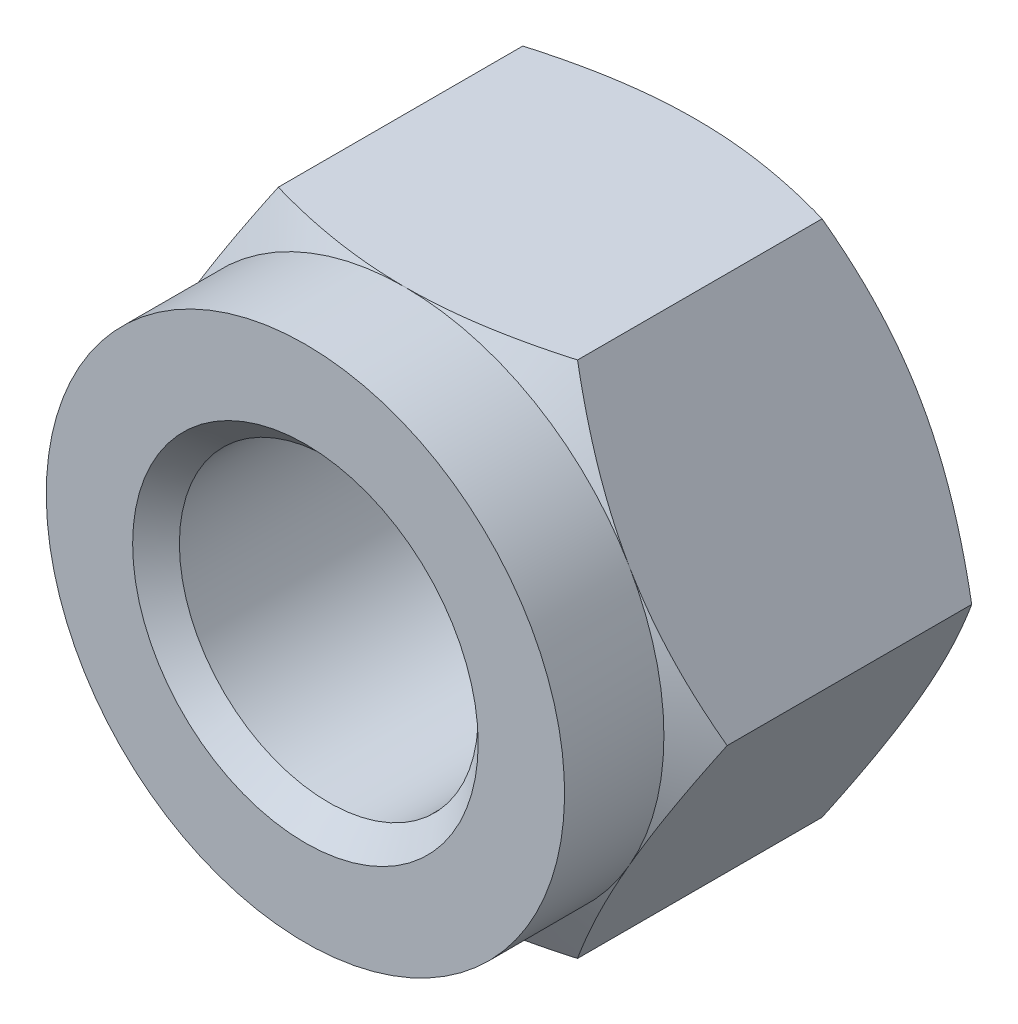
ISO-10303-21;
HEADER;
FILE_DESCRIPTION(('STEP AP214'),'2;1');
FILE_NAME('part.step','',(''),(''),'','','');
FILE_SCHEMA(('AUTOMOTIVE_DESIGN { 1 0 10303 214 1 1 1 1 }'));
ENDSEC;
DATA;
#1=APPLICATION_CONTEXT('core data for automotive mechanical design processes');
#2=APPLICATION_PROTOCOL_DEFINITION('international standard','automotive_design',2000,#1);
#3=PRODUCT_CONTEXT('',#1,'mechanical');
#4=PRODUCT('Part','Part','',(#3));
#5=PRODUCT_RELATED_PRODUCT_CATEGORY('part','',(#4));
#6=PRODUCT_DEFINITION_FORMATION('','',#4);
#7=PRODUCT_DEFINITION_CONTEXT('part definition',#1,'design');
#8=PRODUCT_DEFINITION('design','',#6,#7);
#9=PRODUCT_DEFINITION_SHAPE('','',#8);
#10=(LENGTH_UNIT() NAMED_UNIT(*) SI_UNIT(.MILLI.,.METRE.));
#11=(NAMED_UNIT(*) PLANE_ANGLE_UNIT() SI_UNIT($,.RADIAN.));
#12=(NAMED_UNIT(*) SI_UNIT($,.STERADIAN.) SOLID_ANGLE_UNIT());
#13=UNCERTAINTY_MEASURE_WITH_UNIT(LENGTH_MEASURE(1.E-05),#10,'distance_accuracy_value','');
#14=(GEOMETRIC_REPRESENTATION_CONTEXT(3) GLOBAL_UNCERTAINTY_ASSIGNED_CONTEXT((#13)) GLOBAL_UNIT_ASSIGNED_CONTEXT((#10,
#11,#12)) REPRESENTATION_CONTEXT('',''));
#15=CARTESIAN_POINT('',(0.,0.,0.));
#16=DIRECTION('',(0.,0.,1.));
#17=DIRECTION('',(1.,0.,0.));
#18=AXIS2_PLACEMENT_3D('',#15,#16,#17);
#19=CARTESIAN_POINT('',(0.,0.,0.));
#20=DIRECTION('',(0.,0.,-1.));
#21=DIRECTION('',(0.,1.,0.));
#22=AXIS2_PLACEMENT_3D('',#19,#20,#21);
#23=PLANE('',#22);
#24=CARTESIAN_POINT('',(0.,0.,0.));
#25=DIRECTION('',(0.,0.,-1.));
#26=DIRECTION('',(0.,1.,0.));
#27=AXIS2_PLACEMENT_3D('',#24,#25,#26);
#28=CIRCLE('',#27,18.);
#29=CARTESIAN_POINT('',(0.,18.,0.));
#30=VERTEX_POINT('',#29);
#31=CARTESIAN_POINT('',(15.5884572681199,9.,0.));
#32=VERTEX_POINT('',#31);
#33=EDGE_CURVE('E158',#30,#32,#28,.T.);
#34=ORIENTED_EDGE('',*,*,#33,.T.);
#35=CARTESIAN_POINT('',(15.5884572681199,-9.,0.));
#36=VERTEX_POINT('',#35);
#37=EDGE_CURVE('E163',#32,#36,#28,.T.);
#38=ORIENTED_EDGE('',*,*,#37,.T.);
#39=CARTESIAN_POINT('',(0.,-18.,0.));
#40=VERTEX_POINT('',#39);
#41=EDGE_CURVE('E292',#36,#40,#28,.T.);
#42=ORIENTED_EDGE('',*,*,#41,.T.);
#43=CARTESIAN_POINT('',(-15.5884572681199,-9.,0.));
#44=VERTEX_POINT('',#43);
#45=EDGE_CURVE('E284',#40,#44,#28,.T.);
#46=ORIENTED_EDGE('',*,*,#45,.T.);
#47=CARTESIAN_POINT('',(-15.5884572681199,9.,0.));
#48=VERTEX_POINT('',#47);
#49=EDGE_CURVE('E339',#44,#48,#28,.T.);
#50=ORIENTED_EDGE('',*,*,#49,.T.);
#51=EDGE_CURVE('E152',#48,#30,#28,.T.);
#52=ORIENTED_EDGE('',*,*,#51,.T.);
#53=EDGE_LOOP('',(#34,#38,#42,#46,#50,#52));
#54=FACE_BOUND('',#53,.T.);
#55=CARTESIAN_POINT('',(0.,0.,0.));
#56=DIRECTION('',(0.,0.,-1.));
#57=DIRECTION('',(-1.,0.,0.));
#58=AXIS2_PLACEMENT_3D('',#55,#56,#57);
#59=CIRCLE('',#58,12.);
#60=CARTESIAN_POINT('',(-12.,0.,0.));
#61=VERTEX_POINT('',#60);
#62=EDGE_CURVE('E549',#61,#61,#59,.T.);
#63=ORIENTED_EDGE('',*,*,#62,.F.);
#64=EDGE_LOOP('',(#63));
#65=FACE_BOUND('',#64,.T.);
#66=ADVANCED_FACE('F16',(#54,#65),#23,.T.);
#67=CARTESIAN_POINT('',(0.,0.,27.1));
#68=DIRECTION('',(0.,0.,1.));
#69=DIRECTION('',(1.,0.,0.));
#70=AXIS2_PLACEMENT_3D('',#67,#68,#69);
#71=PLANE('',#70);
#72=CARTESIAN_POINT('',(0.,0.,27.1));
#73=DIRECTION('',(0.,0.,-1.));
#74=DIRECTION('',(0.,1.,0.));
#75=AXIS2_PLACEMENT_3D('',#72,#73,#74);
#76=CIRCLE('',#75,18.);
#77=CARTESIAN_POINT('',(0.,18.,27.1));
#78=VERTEX_POINT('',#77);
#79=EDGE_CURVE('E156',#78,#78,#76,.T.);
#80=ORIENTED_EDGE('',*,*,#79,.F.);
#81=EDGE_LOOP('',(#80));
#82=FACE_BOUND('',#81,.T.);
#83=CARTESIAN_POINT('',(0.,0.,27.1));
#84=DIRECTION('',(0.,0.,-1.));
#85=DIRECTION('',(-1.,0.,0.));
#86=AXIS2_PLACEMENT_3D('',#83,#84,#85);
#87=CIRCLE('',#86,12.);
#88=CARTESIAN_POINT('',(-12.,0.,27.1));
#89=VERTEX_POINT('',#88);
#90=EDGE_CURVE('E553',#89,#89,#87,.T.);
#91=ORIENTED_EDGE('',*,*,#90,.T.);
#92=EDGE_LOOP('',(#91));
#93=FACE_BOUND('',#92,.T.);
#94=ADVANCED_FACE('F357',(#82,#93),#71,.T.);
#95=CARTESIAN_POINT('',(0.,0.,0.));
#96=DIRECTION('',(0.,0.,1.));
#97=DIRECTION('',(0.,-1.,0.));
#98=AXIS2_PLACEMENT_3D('',#95,#96,#97);
#99=CONICAL_SURFACE('',#98,18.,1.0471975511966);
#100=CARTESIAN_POINT('',(-20.784610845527,-1.99999999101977E-06,1.60769582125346));
#101=CARTESIAN_POINT('',(-20.5561932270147,0.395628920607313,1.47583009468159));
#102=CARTESIAN_POINT('',(-20.3268846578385,0.792803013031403,1.34994841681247));
#103=CARTESIAN_POINT('',(-19.8664287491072,1.59033604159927,1.11181647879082));
#104=CARTESIAN_POINT('',(-19.635280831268,1.9906959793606,0.999570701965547));
#105=CARTESIAN_POINT('',(-19.1706995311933,2.79537439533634,0.79021942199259));
#106=CARTESIAN_POINT('',(-18.9372620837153,3.1996999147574,0.693149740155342));
#107=CARTESIAN_POINT('',(-18.4687651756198,4.01116036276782,0.516235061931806));
#108=CARTESIAN_POINT('',(-18.2337058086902,4.41829512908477,0.436389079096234));
#109=CARTESIAN_POINT('',(-17.7679879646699,5.22494209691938,0.297317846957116));
#110=CARTESIAN_POINT('',(-17.5373640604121,5.62439441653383,0.237632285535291));
#111=CARTESIAN_POINT('',(-17.0750595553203,6.42512930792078,0.137553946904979));
#112=CARTESIAN_POINT('',(-16.8433789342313,6.82641191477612,0.0971615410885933));
#113=CARTESIAN_POINT('',(-16.3796285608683,7.62965112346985,0.0366893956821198));
#114=CARTESIAN_POINT('',(-16.1475596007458,8.03160635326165,0.0165855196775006));
#115=CARTESIAN_POINT('',(-15.6832075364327,8.83588772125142,-0.00287722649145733));
#116=CARTESIAN_POINT('',(-15.450924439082,9.23821384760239,-0.0022367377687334));
#117=CARTESIAN_POINT('',(-15.0166733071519,9.99035887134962,0.0183396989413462));
#118=CARTESIAN_POINT('',(-14.814674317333,10.3402313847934,0.0357665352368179));
#119=CARTESIAN_POINT('',(-14.4111581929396,11.0391418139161,0.0859775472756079));
#120=CARTESIAN_POINT('',(-14.209641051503,11.3881797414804,0.118761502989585));
#121=CARTESIAN_POINT('',(-13.8071649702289,12.0852887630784,0.199117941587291));
#122=CARTESIAN_POINT('',(-13.6062067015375,12.4333586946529,0.246703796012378));
#123=CARTESIAN_POINT('',(-13.205246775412,13.1278416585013,0.355824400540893));
#124=CARTESIAN_POINT('',(-13.0052451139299,13.4742546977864,0.417359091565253));
#125=CARTESIAN_POINT('',(-12.3981147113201,14.5258354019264,0.624451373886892));
#126=CARTESIAN_POINT('',(-11.9927440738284,15.2279579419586,0.790657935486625));
#127=CARTESIAN_POINT('',(-11.1880469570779,16.6217342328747,1.1678776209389));
#128=CARTESIAN_POINT('',(-10.788710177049,17.3134058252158,1.37880216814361));
#129=CARTESIAN_POINT('',(-10.3923036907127,18.000002,1.60769582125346));
#130=B_SPLINE_CURVE_WITH_KNOTS('',3,(#100,#101,#102,#103,#104,#105,#106,#107,#108,#109,#110,
#111,#112,#113,#114,#115,#116,#117,#118,#119,#120,#121,#122,#123,#124,#125,#126,#127,#128,#129),
.UNSPECIFIED.,.F.,.F.,(4,2,2,2,2,2,2,2,2,2,2,2,2,2,4),(0.,1.42649553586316,2.85345882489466,
4.28374102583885,5.71394128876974,7.10884191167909,8.50376938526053,9.89703540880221,
11.290258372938,12.5030869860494,13.7158982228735,14.9298082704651,16.1437131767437,
18.6249911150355,21.1013993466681),.UNSPECIFIED.);
#131=CARTESIAN_POINT('',(-10.3923048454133,18.,1.60769515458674));
#132=VERTEX_POINT('',#131);
#133=EDGE_CURVE('E243',#48,#132,#130,.T.);
#134=ORIENTED_EDGE('',*,*,#133,.T.);
#135=CARTESIAN_POINT('',(-27.5623556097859,18.,8.61368935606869));
#136=CARTESIAN_POINT('',(-27.1672177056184,18.,8.42268465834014));
#137=CARTESIAN_POINT('',(-26.771602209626,18.,8.23266845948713));
#138=CARTESIAN_POINT('',(-25.9793151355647,18.,7.85483995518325));
#139=CARTESIAN_POINT('',(-25.5826435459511,18.,7.667027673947));
#140=CARTESIAN_POINT('',(-24.3907771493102,18.,7.10718264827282));
#141=CARTESIAN_POINT('',(-23.5938591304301,18.,6.73880397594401));
#142=CARTESIAN_POINT('',(-21.9899562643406,18.,6.01206116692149));
#143=CARTESIAN_POINT('',(-21.1829399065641,18.,5.6537663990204));
#144=CARTESIAN_POINT('',(-19.5622752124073,18.,4.9525597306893));
#145=CARTESIAN_POINT('',(-18.7486272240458,18.,4.60964702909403));
#146=CARTESIAN_POINT('',(-17.103302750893,18.,3.9392328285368));
#147=CARTESIAN_POINT('',(-16.2715275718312,18.,3.61197227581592));
#148=CARTESIAN_POINT('',(-14.5981607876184,18.,2.98307994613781));
#149=CARTESIAN_POINT('',(-13.7565681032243,18.,2.68145101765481));
#150=CARTESIAN_POINT('',(-12.0639835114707,18.,2.11193037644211));
#151=CARTESIAN_POINT('',(-11.2130159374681,18.,1.84396693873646));
#152=CARTESIAN_POINT('',(-9.49890089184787,18.,1.35046629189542));
#153=CARTESIAN_POINT('',(-8.63575736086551,18.,1.12491568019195));
#154=CARTESIAN_POINT('',(-7.33174610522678,18.,0.826655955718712));
#155=CARTESIAN_POINT('',(-6.89543387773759,18.,0.733898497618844));
#156=CARTESIAN_POINT('',(-6.01990543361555,18.,0.563203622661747));
#157=CARTESIAN_POINT('',(-5.58068928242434,18.,0.485265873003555));
#158=CARTESIAN_POINT('',(-4.69964773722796,18.,0.345592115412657));
#159=CARTESIAN_POINT('',(-4.25782218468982,18.,0.283857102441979));
#160=CARTESIAN_POINT('',(-3.37206807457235,18.,0.177828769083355));
#161=CARTESIAN_POINT('',(-2.92813951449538,18.,0.133535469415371));
#162=CARTESIAN_POINT('',(-2.04164516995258,18.,0.0635830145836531));
#163=CARTESIAN_POINT('',(-1.59908864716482,18.,0.0378072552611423));
#164=CARTESIAN_POINT('',(-0.713283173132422,18.,0.00502539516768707));
#165=CARTESIAN_POINT('',(-0.270034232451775,18.,-0.00198098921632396));
#166=CARTESIAN_POINT('',(0.616237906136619,18.,0.00294207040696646));
#167=CARTESIAN_POINT('',(1.05926113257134,18.,0.0148662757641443));
#168=CARTESIAN_POINT('',(1.94441482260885,18.,0.0573540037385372));
#169=CARTESIAN_POINT('',(2.38654524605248,18.,0.0879183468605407));
#170=CARTESIAN_POINT('',(3.45779585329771,18.,0.183918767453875));
#171=CARTESIAN_POINT('',(4.08609712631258,18.,0.258674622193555));
#172=CARTESIAN_POINT('',(5.33777794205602,18.,0.441667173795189));
#173=CARTESIAN_POINT('',(5.96115674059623,18.,0.549908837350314));
#174=CARTESIAN_POINT('',(7.82499681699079,18.,0.919433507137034));
#175=CARTESIAN_POINT('',(9.05672705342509,18.,1.22527021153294));
#176=CARTESIAN_POINT('',(10.8991905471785,18.,1.75263766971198));
#177=CARTESIAN_POINT('',(11.5195501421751,18.,1.94244300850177));
#178=CARTESIAN_POINT('',(12.7542760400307,18.,2.34097898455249));
#179=CARTESIAN_POINT('',(13.3686417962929,18.,2.54971133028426));
#180=CARTESIAN_POINT('',(14.5883176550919,18.,2.98165368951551));
#181=CARTESIAN_POINT('',(15.193659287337,18.,3.20477542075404));
#182=CARTESIAN_POINT('',(16.097859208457,18.,3.54911869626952));
#183=CARTESIAN_POINT('',(16.3985751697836,18.,3.66549019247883));
#184=CARTESIAN_POINT('',(16.9988388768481,18.,3.90119206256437));
#185=CARTESIAN_POINT('',(17.2983866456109,18.,4.02052237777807));
#186=CARTESIAN_POINT('',(17.5973908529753,18.,4.14119857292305));
#187=B_SPLINE_CURVE_WITH_KNOTS('',3,(#135,#136,#137,#138,#139,#140,#141,#142,#143,#144,#145,
#146,#147,#148,#149,#150,#151,#152,#153,#154,#155,#156,#157,#158,#159,#160,#161,#162,#163,#164,
#165,#166,#167,#168,#169,#170,#171,#172,#173,#174,#175,#176,#177,#178,#179,#180,#181,#182,#183,
#184,#185,#186),.UNSPECIFIED.,.F.,.F.,(4,2,2,2,2,2,2,2,2,2,2,2,2,2,2,2,2,2,2,2,2,2,2,2,2,4),(0.,
1.31664120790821,2.63329686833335,5.26703629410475,7.91584679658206,10.5645191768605,
13.2457156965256,15.9272097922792,18.6028903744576,21.2777240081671,22.6157021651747,
23.9536502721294,25.2916805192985,26.6297123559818,27.959242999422,29.2887535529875,
30.6178962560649,31.9470974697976,33.844218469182,35.7416209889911,39.5437347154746,
41.4898216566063,43.4360844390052,45.3713716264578,46.3387006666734,47.3060105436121),.UNSPECIFIED.);
#188=EDGE_CURVE('E242',#132,#30,#187,.T.);
#189=ORIENTED_EDGE('',*,*,#188,.T.);
#190=ORIENTED_EDGE('',*,*,#51,.F.);
#191=EDGE_LOOP('',(#134,#189,#190));
#192=FACE_BOUND('',#191,.T.);
#193=ADVANCED_FACE('F187',(#192),#99,.T.);
#194=ORIENTED_EDGE('',*,*,#33,.F.);
#195=CARTESIAN_POINT('',(10.3923048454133,18.,1.60769515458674));
#196=VERTEX_POINT('',#195);
#197=EDGE_CURVE('E235',#30,#196,#187,.T.);
#198=ORIENTED_EDGE('',*,*,#197,.T.);
#199=CARTESIAN_POINT('',(10.3923036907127,18.000002,1.60769582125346));
#200=CARTESIAN_POINT('',(10.6207213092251,17.6043710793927,1.4758300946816));
#201=CARTESIAN_POINT('',(10.8500298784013,17.2071969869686,1.34994841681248));
#202=CARTESIAN_POINT('',(11.3104857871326,16.4096639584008,1.11181647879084));
#203=CARTESIAN_POINT('',(11.5416337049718,16.0093040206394,0.999570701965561));
#204=CARTESIAN_POINT('',(12.0062150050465,15.2046256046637,0.790219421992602));
#205=CARTESIAN_POINT('',(12.2396524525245,14.8003000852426,0.693149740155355));
#206=CARTESIAN_POINT('',(12.70814936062,13.9888396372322,0.516235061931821));
#207=CARTESIAN_POINT('',(12.9432087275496,13.5817048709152,0.436389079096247));
#208=CARTESIAN_POINT('',(13.4089265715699,12.7750579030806,0.297317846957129));
#209=CARTESIAN_POINT('',(13.6395504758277,12.3756055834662,0.237632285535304));
#210=CARTESIAN_POINT('',(14.1018549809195,11.5748706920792,0.137553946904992));
#211=CARTESIAN_POINT('',(14.3335356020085,11.1735880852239,0.0971615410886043));
#212=CARTESIAN_POINT('',(14.7972859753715,10.3703488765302,0.0366893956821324));
#213=CARTESIAN_POINT('',(15.029354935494,9.96839364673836,0.0165855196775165));
#214=CARTESIAN_POINT('',(15.4937069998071,9.16411227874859,-0.00287722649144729));
#215=CARTESIAN_POINT('',(15.7259900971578,8.76178615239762,-0.00223673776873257));
#216=CARTESIAN_POINT('',(16.1602412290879,8.00964112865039,0.0183396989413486));
#217=CARTESIAN_POINT('',(16.3622402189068,7.65976861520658,0.0357665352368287));
#218=CARTESIAN_POINT('',(16.7657563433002,6.96085818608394,0.0859775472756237));
#219=CARTESIAN_POINT('',(16.9672734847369,6.61182025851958,0.118761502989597));
#220=CARTESIAN_POINT('',(17.3697495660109,5.91471123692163,0.199117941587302));
#221=CARTESIAN_POINT('',(17.5707078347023,5.5666413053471,0.246703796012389));
#222=CARTESIAN_POINT('',(17.9716677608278,4.87215834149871,0.355824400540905));
#223=CARTESIAN_POINT('',(18.1716694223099,4.52574530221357,0.417359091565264));
#224=CARTESIAN_POINT('',(18.7787998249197,3.47416459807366,0.624451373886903));
#225=CARTESIAN_POINT('',(19.1841704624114,2.7720420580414,0.790657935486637));
#226=CARTESIAN_POINT('',(19.9888675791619,1.3782657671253,1.16787762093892));
#227=CARTESIAN_POINT('',(20.3882043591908,0.686594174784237,1.37880216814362));
#228=CARTESIAN_POINT('',(20.784610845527,-2.00000000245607E-06,1.60769582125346));
#229=B_SPLINE_CURVE_WITH_KNOTS('',3,(#199,#200,#201,#202,#203,#204,#205,#206,#207,#208,#209,
#210,#211,#212,#213,#214,#215,#216,#217,#218,#219,#220,#221,#222,#223,#224,#225,#226,#227,#228),
.UNSPECIFIED.,.F.,.F.,(4,2,2,2,2,2,2,2,2,2,2,2,2,2,4),(0.,1.42649553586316,2.85345882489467,
4.28374102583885,5.71394128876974,7.10884191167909,8.50376938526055,9.89703540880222,
11.290258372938,12.5030869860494,13.7158982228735,14.9298082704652,16.1437131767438,
18.6249911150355,21.1013993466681),.UNSPECIFIED.);
#230=EDGE_CURVE('E229',#196,#32,#229,.T.);
#231=ORIENTED_EDGE('',*,*,#230,.T.);
#232=EDGE_LOOP('',(#194,#198,#231));
#233=FACE_BOUND('',#232,.T.);
#234=ADVANCED_FACE('F330',(#233),#99,.T.);
#235=ORIENTED_EDGE('',*,*,#37,.F.);
#236=CARTESIAN_POINT('',(20.7846096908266,0.,1.60769515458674));
#237=VERTEX_POINT('',#236);
#238=EDGE_CURVE('E46',#32,#237,#229,.T.);
#239=ORIENTED_EDGE('',*,*,#238,.T.);
#240=CARTESIAN_POINT('',(20.784610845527,1.99999999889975E-06,1.60769582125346));
#241=CARTESIAN_POINT('',(20.5561932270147,-0.395628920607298,1.47583009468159));
#242=CARTESIAN_POINT('',(20.3268846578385,-0.792803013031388,1.34994841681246));
#243=CARTESIAN_POINT('',(19.8664287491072,-1.59033604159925,1.11181647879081));
#244=CARTESIAN_POINT('',(19.635280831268,-1.99069597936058,0.99957070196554));
#245=CARTESIAN_POINT('',(19.1706995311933,-2.79537439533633,0.790219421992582));
#246=CARTESIAN_POINT('',(18.9372620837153,-3.19969991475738,0.693149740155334));
#247=CARTESIAN_POINT('',(18.4687651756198,-4.0111603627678,0.516235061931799));
#248=CARTESIAN_POINT('',(18.2337058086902,-4.41829512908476,0.436389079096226));
#249=CARTESIAN_POINT('',(17.7679879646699,-5.22494209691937,0.297317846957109));
#250=CARTESIAN_POINT('',(17.5373640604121,-5.62439441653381,0.237632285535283));
#251=CARTESIAN_POINT('',(17.0750595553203,-6.42512930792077,0.137553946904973));
#252=CARTESIAN_POINT('',(16.8433789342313,-6.8264119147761,0.0971615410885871));
#253=CARTESIAN_POINT('',(16.3796285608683,-7.62965112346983,0.0366893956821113));
#254=CARTESIAN_POINT('',(16.1475596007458,-8.03160635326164,0.0165855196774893));
#255=CARTESIAN_POINT('',(15.6832075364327,-8.8358877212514,-0.00287722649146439));
#256=CARTESIAN_POINT('',(15.450924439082,-9.23821384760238,-0.0022367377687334));
#257=CARTESIAN_POINT('',(15.0166733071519,-9.99035887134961,0.018339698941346));
#258=CARTESIAN_POINT('',(14.814674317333,-10.3402313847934,0.0357665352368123));
#259=CARTESIAN_POINT('',(14.4111581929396,-11.0391418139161,0.0859775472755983));
#260=CARTESIAN_POINT('',(14.2096410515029,-11.3881797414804,0.118761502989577));
#261=CARTESIAN_POINT('',(13.8071649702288,-12.0852887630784,0.199117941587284));
#262=CARTESIAN_POINT('',(13.6062067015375,-12.4333586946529,0.246703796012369));
#263=CARTESIAN_POINT('',(13.205246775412,-13.1278416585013,0.355824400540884));
#264=CARTESIAN_POINT('',(13.0052451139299,-13.4742546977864,0.417359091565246));
#265=CARTESIAN_POINT('',(12.3981147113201,-14.5258354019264,0.624451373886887));
#266=CARTESIAN_POINT('',(11.9927440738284,-15.2279579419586,0.790657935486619));
#267=CARTESIAN_POINT('',(11.1880469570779,-16.6217342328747,1.1678776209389));
#268=CARTESIAN_POINT('',(10.7887101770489,-17.3134058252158,1.3788021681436));
#269=CARTESIAN_POINT('',(10.3923036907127,-18.000002,1.60769582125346));
#270=B_SPLINE_CURVE_WITH_KNOTS('',3,(#240,#241,#242,#243,#244,#245,#246,#247,#248,#249,#250,
#251,#252,#253,#254,#255,#256,#257,#258,#259,#260,#261,#262,#263,#264,#265,#266,#267,#268,#269),
.UNSPECIFIED.,.F.,.F.,(4,2,2,2,2,2,2,2,2,2,2,2,2,2,4),(0.,1.42649553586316,2.85345882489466,
4.28374102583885,5.71394128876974,7.10884191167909,8.50376938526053,9.89703540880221,
11.290258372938,12.5030869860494,13.7158982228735,14.9298082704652,16.1437131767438,
18.6249911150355,21.1013993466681),.UNSPECIFIED.);
#271=EDGE_CURVE('E295',#237,#36,#270,.T.);
#272=ORIENTED_EDGE('',*,*,#271,.T.);
#273=EDGE_LOOP('',(#235,#239,#272));
#274=FACE_BOUND('',#273,.T.);
#275=ADVANCED_FACE('F333',(#274),#99,.T.);
#276=CARTESIAN_POINT('',(-10.3923036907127,-18.000002,1.60769582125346));
#277=CARTESIAN_POINT('',(-10.6207213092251,-17.6043710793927,1.4758300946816));
#278=CARTESIAN_POINT('',(-10.8500298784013,-17.2071969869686,1.34994841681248));
#279=CARTESIAN_POINT('',(-11.3104857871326,-16.4096639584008,1.11181647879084));
#280=CARTESIAN_POINT('',(-11.5416337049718,-16.0093040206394,0.999570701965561));
#281=CARTESIAN_POINT('',(-12.0062150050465,-15.2046256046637,0.790219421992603));
#282=CARTESIAN_POINT('',(-12.2396524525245,-14.8003000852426,0.693149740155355));
#283=CARTESIAN_POINT('',(-12.70814936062,-13.9888396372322,0.516235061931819));
#284=CARTESIAN_POINT('',(-12.9432087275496,-13.5817048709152,0.436389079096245));
#285=CARTESIAN_POINT('',(-13.4089265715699,-12.7750579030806,0.297317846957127));
#286=CARTESIAN_POINT('',(-13.6395504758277,-12.3756055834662,0.237632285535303));
#287=CARTESIAN_POINT('',(-14.1018549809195,-11.5748706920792,0.137553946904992));
#288=CARTESIAN_POINT('',(-14.3335356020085,-11.1735880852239,0.0971615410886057));
#289=CARTESIAN_POINT('',(-14.7972859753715,-10.3703488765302,0.036689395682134));
#290=CARTESIAN_POINT('',(-15.029354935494,-9.96839364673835,0.0165855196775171));
#291=CARTESIAN_POINT('',(-15.4937069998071,-9.16411227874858,-0.00287722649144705));
#292=CARTESIAN_POINT('',(-15.7259900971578,-8.76178615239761,-0.0022367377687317));
#293=CARTESIAN_POINT('',(-16.1602412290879,-8.00964112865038,0.0183396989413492));
#294=CARTESIAN_POINT('',(-16.3622402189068,-7.65976861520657,0.0357665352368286));
#295=CARTESIAN_POINT('',(-16.7657563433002,-6.96085818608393,0.0859775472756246));
#296=CARTESIAN_POINT('',(-16.9672734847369,-6.61182025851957,0.1187615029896));
#297=CARTESIAN_POINT('',(-17.3697495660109,-5.91471123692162,0.199117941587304));
#298=CARTESIAN_POINT('',(-17.5707078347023,-5.5666413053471,0.24670379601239));
#299=CARTESIAN_POINT('',(-17.9716677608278,-4.8721583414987,0.355824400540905));
#300=CARTESIAN_POINT('',(-18.1716694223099,-4.52574530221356,0.417359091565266));
#301=CARTESIAN_POINT('',(-18.7787998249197,-3.47416459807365,0.624451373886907));
#302=CARTESIAN_POINT('',(-19.1841704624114,-2.77204205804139,0.790657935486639));
#303=CARTESIAN_POINT('',(-19.9888675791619,-1.3782657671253,1.16787762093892));
#304=CARTESIAN_POINT('',(-20.3882043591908,-0.686594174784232,1.37880216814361));
#305=CARTESIAN_POINT('',(-20.784610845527,2.00000000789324E-06,1.60769582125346));
#306=B_SPLINE_CURVE_WITH_KNOTS('',3,(#276,#277,#278,#279,#280,#281,#282,#283,#284,#285,#286,
#287,#288,#289,#290,#291,#292,#293,#294,#295,#296,#297,#298,#299,#300,#301,#302,#303,#304,#305),
.UNSPECIFIED.,.F.,.F.,(4,2,2,2,2,2,2,2,2,2,2,2,2,2,4),(0.,1.42649553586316,2.85345882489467,
4.28374102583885,5.71394128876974,7.10884191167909,8.50376938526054,9.89703540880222,
11.290258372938,12.5030869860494,13.7158982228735,14.9298082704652,16.1437131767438,
18.6249911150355,21.1013993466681),.UNSPECIFIED.);
#307=CARTESIAN_POINT('',(-20.7846096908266,0.,1.60769515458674));
#308=VERTEX_POINT('',#307);
#309=EDGE_CURVE('E299',#44,#308,#306,.T.);
#310=ORIENTED_EDGE('',*,*,#309,.T.);
#311=EDGE_CURVE('E230',#308,#48,#130,.T.);
#312=ORIENTED_EDGE('',*,*,#311,.T.);
#313=ORIENTED_EDGE('',*,*,#49,.F.);
#314=EDGE_LOOP('',(#310,#312,#313));
#315=FACE_BOUND('',#314,.T.);
#316=ADVANCED_FACE('F393',(#315),#99,.T.);
#317=ORIENTED_EDGE('',*,*,#41,.F.);
#318=CARTESIAN_POINT('',(10.3923048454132,-18.,1.60769515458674));
#319=VERTEX_POINT('',#318);
#320=EDGE_CURVE('E38',#36,#319,#270,.T.);
#321=ORIENTED_EDGE('',*,*,#320,.T.);
#322=CARTESIAN_POINT('',(-27.5623556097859,-18.,8.61368935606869));
#323=CARTESIAN_POINT('',(-27.1672177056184,-18.,8.42268465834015));
#324=CARTESIAN_POINT('',(-26.771602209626,-18.,8.23266845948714));
#325=CARTESIAN_POINT('',(-25.9793151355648,-18.,7.85483995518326));
#326=CARTESIAN_POINT('',(-25.5826435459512,-18.,7.66702767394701));
#327=CARTESIAN_POINT('',(-24.3907771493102,-18.,7.10718264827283));
#328=CARTESIAN_POINT('',(-23.5938591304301,-18.,6.73880397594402));
#329=CARTESIAN_POINT('',(-21.9899562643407,-18.,6.0120611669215));
#330=CARTESIAN_POINT('',(-21.1829399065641,-18.,5.65376639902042));
#331=CARTESIAN_POINT('',(-19.5622752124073,-18.,4.95255973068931));
#332=CARTESIAN_POINT('',(-18.7486272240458,-18.,4.60964702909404));
#333=CARTESIAN_POINT('',(-17.103302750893,-18.,3.93923282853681));
#334=CARTESIAN_POINT('',(-16.2715275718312,-18.,3.61197227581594));
#335=CARTESIAN_POINT('',(-14.5981607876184,-18.,2.98307994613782));
#336=CARTESIAN_POINT('',(-13.7565681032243,-18.,2.68145101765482));
#337=CARTESIAN_POINT('',(-12.0639835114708,-18.,2.11193037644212));
#338=CARTESIAN_POINT('',(-11.2130159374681,-18.,1.84396693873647));
#339=CARTESIAN_POINT('',(-9.4989008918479,-18.,1.35046629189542));
#340=CARTESIAN_POINT('',(-8.63575736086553,-18.,1.12491568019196));
#341=CARTESIAN_POINT('',(-7.3317461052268,-18.,0.826655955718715));
#342=CARTESIAN_POINT('',(-6.89543387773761,-18.,0.733898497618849));
#343=CARTESIAN_POINT('',(-6.01990543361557,-18.,0.563203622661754));
#344=CARTESIAN_POINT('',(-5.58068928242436,-18.,0.485265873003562));
#345=CARTESIAN_POINT('',(-4.69964773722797,-18.,0.345592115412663));
#346=CARTESIAN_POINT('',(-4.25782218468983,-18.,0.283857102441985));
#347=CARTESIAN_POINT('',(-3.37206807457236,-18.,0.17782876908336));
#348=CARTESIAN_POINT('',(-2.92813951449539,-18.,0.133535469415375));
#349=CARTESIAN_POINT('',(-2.0416451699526,-18.,0.0635830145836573));
#350=CARTESIAN_POINT('',(-1.59908864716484,-18.,0.037807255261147));
#351=CARTESIAN_POINT('',(-0.713283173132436,-18.,0.00502539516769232));
#352=CARTESIAN_POINT('',(-0.270034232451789,-18.,-0.00198098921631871));
#353=CARTESIAN_POINT('',(0.616237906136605,-18.,0.00294207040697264));
#354=CARTESIAN_POINT('',(1.05926113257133,-18.,0.0148662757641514));
#355=CARTESIAN_POINT('',(1.94441482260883,-18.,0.0573540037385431));
#356=CARTESIAN_POINT('',(2.38654524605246,-18.,0.0879183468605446));
#357=CARTESIAN_POINT('',(3.4577958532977,-18.,0.183918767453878));
#358=CARTESIAN_POINT('',(4.08609712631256,-18.,0.258674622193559));
#359=CARTESIAN_POINT('',(5.33777794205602,-18.,0.441667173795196));
#360=CARTESIAN_POINT('',(5.96115674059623,-18.,0.549908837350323));
#361=CARTESIAN_POINT('',(7.82499681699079,-18.,0.919433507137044));
#362=CARTESIAN_POINT('',(9.05672705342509,-18.,1.22527021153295));
#363=CARTESIAN_POINT('',(10.8991905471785,-18.,1.75263766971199));
#364=CARTESIAN_POINT('',(11.5195501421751,-18.,1.94244300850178));
#365=CARTESIAN_POINT('',(12.7542760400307,-18.,2.3409789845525));
#366=CARTESIAN_POINT('',(13.3686417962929,-18.,2.54971133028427));
#367=CARTESIAN_POINT('',(14.5883176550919,-18.,2.98165368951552));
#368=CARTESIAN_POINT('',(15.193659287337,-18.,3.20477542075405));
#369=CARTESIAN_POINT('',(16.097859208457,-18.,3.54911869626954));
#370=CARTESIAN_POINT('',(16.3985751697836,-18.,3.66549019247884));
#371=CARTESIAN_POINT('',(16.9988388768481,-18.,3.90119206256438));
#372=CARTESIAN_POINT('',(17.2983866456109,-18.,4.02052237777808));
#373=CARTESIAN_POINT('',(17.5973908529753,-18.,4.14119857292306));
#374=B_SPLINE_CURVE_WITH_KNOTS('',3,(#322,#323,#324,#325,#326,#327,#328,#329,#330,#331,#332,
#333,#334,#335,#336,#337,#338,#339,#340,#341,#342,#343,#344,#345,#346,#347,#348,#349,#350,#351,
#352,#353,#354,#355,#356,#357,#358,#359,#360,#361,#362,#363,#364,#365,#366,#367,#368,#369,#370,
#371,#372,#373),.UNSPECIFIED.,.F.,.F.,(4,2,2,2,2,2,2,2,2,2,2,2,2,2,2,2,2,2,2,2,2,2,2,2,2,4),(0.,
1.31664120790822,2.63329686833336,5.26703629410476,7.91584679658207,10.5645191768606,
13.2457156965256,15.9272097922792,18.6028903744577,21.2777240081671,22.6157021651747,
23.9536502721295,25.2916805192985,26.6297123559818,27.959242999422,29.2887535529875,
30.6178962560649,31.9470974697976,33.844218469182,35.7416209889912,39.5437347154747,
41.4898216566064,43.4360844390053,45.3713716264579,46.3387006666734,47.3060105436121),.UNSPECIFIED.);
#375=EDGE_CURVE('E10',#319,#40,#374,.F.);
#376=ORIENTED_EDGE('',*,*,#375,.T.);
#377=EDGE_LOOP('',(#317,#321,#376));
#378=FACE_BOUND('',#377,.T.);
#379=ADVANCED_FACE('F291',(#378),#99,.T.);
#380=CARTESIAN_POINT('',(-10.3923048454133,-18.,1.60769515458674));
#381=VERTEX_POINT('',#380);
#382=EDGE_CURVE('E21',#40,#381,#374,.F.);
#383=ORIENTED_EDGE('',*,*,#382,.T.);
#384=EDGE_CURVE('E142',#381,#44,#306,.T.);
#385=ORIENTED_EDGE('',*,*,#384,.T.);
#386=ORIENTED_EDGE('',*,*,#45,.F.);
#387=EDGE_LOOP('',(#383,#385,#386));
#388=FACE_BOUND('',#387,.T.);
#389=ADVANCED_FACE('F280',(#388),#99,.T.);
#390=CARTESIAN_POINT('',(10.3923048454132,-18.,21.2));
#391=DIRECTION('',(-0.866025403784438,0.5,0.));
#392=DIRECTION('',(-0.5,-0.866025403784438,0.));
#393=AXIS2_PLACEMENT_3D('',#390,#391,#392);
#394=PLANE('',#393);
#395=CARTESIAN_POINT('',(10.3923036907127,-18.000002,18.5923041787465));
#396=CARTESIAN_POINT('',(10.6207213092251,-17.6043710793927,18.7241699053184));
#397=CARTESIAN_POINT('',(10.8500298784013,-17.2071969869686,18.8500515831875));
#398=CARTESIAN_POINT('',(11.3104857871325,-16.4096639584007,19.0881835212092));
#399=CARTESIAN_POINT('',(11.5416337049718,-16.0093040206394,19.2004292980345));
#400=CARTESIAN_POINT('',(12.0062150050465,-15.2046256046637,19.4097805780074));
#401=CARTESIAN_POINT('',(12.2396524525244,-14.8003000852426,19.5068502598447));
#402=CARTESIAN_POINT('',(12.70814936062,-13.9888396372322,19.6837649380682));
#403=CARTESIAN_POINT('',(12.9432087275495,-13.5817048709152,19.7636109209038));
#404=CARTESIAN_POINT('',(13.4089265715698,-12.7750579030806,19.9026821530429));
#405=CARTESIAN_POINT('',(13.6395504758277,-12.3756055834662,19.9623677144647));
#406=CARTESIAN_POINT('',(14.1018549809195,-11.5748706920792,20.062446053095));
#407=CARTESIAN_POINT('',(14.3335356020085,-11.1735880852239,20.1028384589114));
#408=CARTESIAN_POINT('',(14.7972859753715,-10.3703488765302,20.1633106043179));
#409=CARTESIAN_POINT('',(15.029354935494,-9.96839364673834,20.1834144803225));
#410=CARTESIAN_POINT('',(15.4937069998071,-9.16411227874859,20.2028772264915));
#411=CARTESIAN_POINT('',(15.7259900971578,-8.76178615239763,20.2022367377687));
#412=CARTESIAN_POINT('',(16.1602412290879,-8.0096411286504,20.1816603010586));
#413=CARTESIAN_POINT('',(16.3622402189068,-7.65976861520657,20.1642334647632));
#414=CARTESIAN_POINT('',(16.7657563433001,-6.96085818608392,20.1140224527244));
#415=CARTESIAN_POINT('',(16.9672734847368,-6.61182025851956,20.0812384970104));
#416=CARTESIAN_POINT('',(17.3697495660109,-5.91471123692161,20.0008820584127));
#417=CARTESIAN_POINT('',(17.5707078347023,-5.56664130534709,19.9532962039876));
#418=CARTESIAN_POINT('',(17.9716677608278,-4.8721583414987,19.8441755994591));
#419=CARTESIAN_POINT('',(18.1716694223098,-4.52574530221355,19.7826409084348));
#420=CARTESIAN_POINT('',(18.7787998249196,-3.47416459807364,19.5755486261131));
#421=CARTESIAN_POINT('',(19.1841704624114,-2.77204205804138,19.4093420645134));
#422=CARTESIAN_POINT('',(19.9888675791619,-1.37826576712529,19.0321223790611));
#423=CARTESIAN_POINT('',(20.3882043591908,-0.686594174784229,18.8211978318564));
#424=CARTESIAN_POINT('',(20.784610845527,2.00000000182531E-06,18.5923041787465));
#425=B_SPLINE_CURVE_WITH_KNOTS('',3,(#395,#396,#397,#398,#399,#400,#401,#402,#403,#404,#405,
#406,#407,#408,#409,#410,#411,#412,#413,#414,#415,#416,#417,#418,#419,#420,#421,#422,#423,#424),
.UNSPECIFIED.,.F.,.F.,(4,2,2,2,2,2,2,2,2,2,2,2,2,2,4),(0.,1.42649553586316,2.85345882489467,
4.28374102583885,5.71394128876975,7.1088419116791,8.50376938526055,9.89703540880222,
11.290258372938,12.5030869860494,13.7158982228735,14.9298082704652,16.1437131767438,
18.6249911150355,21.1013993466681),.UNSPECIFIED.);
#426=CARTESIAN_POINT('',(15.5884572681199,-9.,20.2));
#427=VERTEX_POINT('',#426);
#428=CARTESIAN_POINT('',(20.7846096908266,0.,18.5923048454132));
#429=VERTEX_POINT('',#428);
#430=EDGE_CURVE('E131',#427,#429,#425,.T.);
#431=ORIENTED_EDGE('',*,*,#430,.F.);
#432=CARTESIAN_POINT('',(10.3923048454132,-18.,18.5923048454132));
#433=VERTEX_POINT('',#432);
#434=EDGE_CURVE('E132',#433,#427,#425,.T.);
#435=ORIENTED_EDGE('',*,*,#434,.F.);
#436=DIRECTION('',(0.,0.,-1.));
#437=VECTOR('',#436,1.);
#438=CARTESIAN_POINT('',(10.3923048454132,-18.,21.2));
#439=LINE('',#438,#437);
#440=EDGE_CURVE('E244',#433,#319,#439,.T.);
#441=ORIENTED_EDGE('',*,*,#440,.T.);
#442=ORIENTED_EDGE('',*,*,#320,.F.);
#443=ORIENTED_EDGE('',*,*,#271,.F.);
#444=DIRECTION('',(0.,0.,-1.));
#445=VECTOR('',#444,1.);
#446=CARTESIAN_POINT('',(20.7846096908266,0.,21.2));
#447=LINE('',#446,#445);
#448=EDGE_CURVE('E133',#429,#237,#447,.T.);
#449=ORIENTED_EDGE('',*,*,#448,.F.);
#450=EDGE_LOOP('',(#431,#435,#441,#442,#443,#449));
#451=FACE_BOUND('',#450,.T.);
#452=ADVANCED_FACE('F18',(#451),#394,.F.);
#453=CARTESIAN_POINT('',(20.7846096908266,0.,21.2));
#454=DIRECTION('',(-0.866025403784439,-0.5,0.));
#455=DIRECTION('',(0.5,-0.866025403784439,0.));
#456=AXIS2_PLACEMENT_3D('',#453,#454,#455);
#457=PLANE('',#456);
#458=CARTESIAN_POINT('',(20.784610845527,-2.00000000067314E-06,18.5923041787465));
#459=CARTESIAN_POINT('',(20.5561932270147,0.395628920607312,18.7241699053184));
#460=CARTESIAN_POINT('',(20.3268846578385,0.792803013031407,18.8500515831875));
#461=CARTESIAN_POINT('',(19.8664287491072,1.59033604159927,19.0881835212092));
#462=CARTESIAN_POINT('',(19.635280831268,1.9906959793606,19.2004292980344));
#463=CARTESIAN_POINT('',(19.1706995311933,2.79537439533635,19.4097805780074));
#464=CARTESIAN_POINT('',(18.9372620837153,3.1996999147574,19.5068502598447));
#465=CARTESIAN_POINT('',(18.4687651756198,4.01116036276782,19.6837649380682));
#466=CARTESIAN_POINT('',(18.2337058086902,4.41829512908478,19.7636109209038));
#467=CARTESIAN_POINT('',(17.7679879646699,5.22494209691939,19.9026821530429));
#468=CARTESIAN_POINT('',(17.5373640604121,5.62439441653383,19.9623677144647));
#469=CARTESIAN_POINT('',(17.0750595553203,6.42512930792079,20.062446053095));
#470=CARTESIAN_POINT('',(16.8433789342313,6.82641191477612,20.1028384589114));
#471=CARTESIAN_POINT('',(16.3796285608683,7.62965112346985,20.1633106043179));
#472=CARTESIAN_POINT('',(16.1475596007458,8.03160635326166,20.1834144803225));
#473=CARTESIAN_POINT('',(15.6832075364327,8.83588772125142,20.2028772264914));
#474=CARTESIAN_POINT('',(15.450924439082,9.23821384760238,20.2022367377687));
#475=CARTESIAN_POINT('',(15.0166733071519,9.99035887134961,20.1816603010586));
#476=CARTESIAN_POINT('',(14.814674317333,10.3402313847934,20.1642334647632));
#477=CARTESIAN_POINT('',(14.4111581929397,11.0391418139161,20.1140224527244));
#478=CARTESIAN_POINT('',(14.209641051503,11.3881797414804,20.0812384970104));
#479=CARTESIAN_POINT('',(13.8071649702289,12.0852887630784,20.0008820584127));
#480=CARTESIAN_POINT('',(13.6062067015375,12.4333586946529,19.9532962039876));
#481=CARTESIAN_POINT('',(13.205246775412,13.1278416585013,19.8441755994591));
#482=CARTESIAN_POINT('',(13.00524511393,13.4742546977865,19.7826409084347));
#483=CARTESIAN_POINT('',(12.3981147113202,14.5258354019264,19.5755486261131));
#484=CARTESIAN_POINT('',(11.9927440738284,15.2279579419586,19.4093420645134));
#485=CARTESIAN_POINT('',(11.1880469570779,16.6217342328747,19.0321223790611));
#486=CARTESIAN_POINT('',(10.788710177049,17.3134058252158,18.8211978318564));
#487=CARTESIAN_POINT('',(10.3923036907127,18.000002,18.5923041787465));
#488=B_SPLINE_CURVE_WITH_KNOTS('',3,(#458,#459,#460,#461,#462,#463,#464,#465,#466,#467,#468,
#469,#470,#471,#472,#473,#474,#475,#476,#477,#478,#479,#480,#481,#482,#483,#484,#485,#486,#487),
.UNSPECIFIED.,.F.,.F.,(4,2,2,2,2,2,2,2,2,2,2,2,2,2,4),(0.,1.42649553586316,2.85345882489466,
4.28374102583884,5.71394128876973,7.10884191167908,8.50376938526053,9.8970354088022,
11.290258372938,12.5030869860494,13.7158982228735,14.9298082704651,16.1437131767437,
18.6249911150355,21.1013993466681),.UNSPECIFIED.);
#489=CARTESIAN_POINT('',(15.5884572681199,9.,20.2));
#490=VERTEX_POINT('',#489);
#491=CARTESIAN_POINT('',(10.3923048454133,18.,18.5923048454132));
#492=VERTEX_POINT('',#491);
#493=EDGE_CURVE('E205',#490,#492,#488,.T.);
#494=ORIENTED_EDGE('',*,*,#493,.F.);
#495=EDGE_CURVE('E137',#429,#490,#488,.T.);
#496=ORIENTED_EDGE('',*,*,#495,.F.);
#497=ORIENTED_EDGE('',*,*,#448,.T.);
#498=ORIENTED_EDGE('',*,*,#238,.F.);
#499=ORIENTED_EDGE('',*,*,#230,.F.);
#500=DIRECTION('',(0.,0.,-1.));
#501=VECTOR('',#500,1.);
#502=CARTESIAN_POINT('',(10.3923048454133,18.,21.2));
#503=LINE('',#502,#501);
#504=EDGE_CURVE('E258',#492,#196,#503,.T.);
#505=ORIENTED_EDGE('',*,*,#504,.F.);
#506=EDGE_LOOP('',(#494,#496,#497,#498,#499,#505));
#507=FACE_BOUND('',#506,.T.);
#508=ADVANCED_FACE('F216',(#507),#457,.F.);
#509=CARTESIAN_POINT('',(10.3923048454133,18.,21.2));
#510=DIRECTION('',(0.,-1.,0.));
#511=DIRECTION('',(1.,0.,0.));
#512=AXIS2_PLACEMENT_3D('',#509,#510,#511);
#513=PLANE('',#512);
#514=CARTESIAN_POINT('',(-27.5623556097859,18.,11.5863106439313));
#515=CARTESIAN_POINT('',(-27.1672177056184,18.,11.7773153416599));
#516=CARTESIAN_POINT('',(-26.771602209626,18.,11.9673315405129));
#517=CARTESIAN_POINT('',(-25.9793151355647,18.,12.3451600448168));
#518=CARTESIAN_POINT('',(-25.5826435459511,18.,12.532972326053));
#519=CARTESIAN_POINT('',(-24.3907771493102,18.,13.0928173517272));
#520=CARTESIAN_POINT('',(-23.5938591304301,18.,13.461196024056));
#521=CARTESIAN_POINT('',(-21.9899562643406,18.,14.1879388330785));
#522=CARTESIAN_POINT('',(-21.1829399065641,18.,14.5462336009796));
#523=CARTESIAN_POINT('',(-19.5622752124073,18.,15.2474402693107));
#524=CARTESIAN_POINT('',(-18.7486272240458,18.,15.590352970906));
#525=CARTESIAN_POINT('',(-17.103302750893,18.,16.2607671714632));
#526=CARTESIAN_POINT('',(-16.2715275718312,18.,16.5880277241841));
#527=CARTESIAN_POINT('',(-14.5981607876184,18.,17.2169200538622));
#528=CARTESIAN_POINT('',(-13.7565681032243,18.,17.5185489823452));
#529=CARTESIAN_POINT('',(-12.0639835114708,18.,18.0880696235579));
#530=CARTESIAN_POINT('',(-11.2130159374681,18.,18.3560330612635));
#531=CARTESIAN_POINT('',(-9.49890089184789,18.,18.8495337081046));
#532=CARTESIAN_POINT('',(-8.63575736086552,18.,19.0750843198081));
#533=CARTESIAN_POINT('',(-7.33174610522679,18.,19.3733440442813));
#534=CARTESIAN_POINT('',(-6.8954338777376,18.,19.4661015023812));
#535=CARTESIAN_POINT('',(-6.01990543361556,18.,19.6367963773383));
#536=CARTESIAN_POINT('',(-5.58068928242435,18.,19.7147341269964));
#537=CARTESIAN_POINT('',(-4.69964773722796,18.,19.8544078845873));
#538=CARTESIAN_POINT('',(-4.25782218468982,18.,19.916142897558));
#539=CARTESIAN_POINT('',(-3.37206807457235,18.,20.0221712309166));
#540=CARTESIAN_POINT('',(-2.92813951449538,18.,20.0664645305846));
#541=CARTESIAN_POINT('',(-2.04164516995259,18.,20.1364169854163));
#542=CARTESIAN_POINT('',(-1.59908864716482,18.,20.1621927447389));
#543=CARTESIAN_POINT('',(-0.713283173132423,18.,20.1949746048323));
#544=CARTESIAN_POINT('',(-0.270034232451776,18.,20.2019809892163));
#545=CARTESIAN_POINT('',(0.616237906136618,18.,20.197057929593));
#546=CARTESIAN_POINT('',(1.05926113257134,18.,20.1851337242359));
#547=CARTESIAN_POINT('',(1.94441482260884,18.,20.1426459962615));
#548=CARTESIAN_POINT('',(2.38654524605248,18.,20.1120816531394));
#549=CARTESIAN_POINT('',(3.45779585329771,18.,20.0160812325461));
#550=CARTESIAN_POINT('',(4.08609712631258,18.,19.9413253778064));
#551=CARTESIAN_POINT('',(5.33777794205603,18.,19.7583328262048));
#552=CARTESIAN_POINT('',(5.96115674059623,18.,19.6500911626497));
#553=CARTESIAN_POINT('',(7.82499681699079,18.,19.280566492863));
#554=CARTESIAN_POINT('',(9.05672705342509,18.,18.9747297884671));
#555=CARTESIAN_POINT('',(10.8991905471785,18.,18.447362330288));
#556=CARTESIAN_POINT('',(11.5195501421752,18.,18.2575569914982));
#557=CARTESIAN_POINT('',(12.7542760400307,18.,17.8590210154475));
#558=CARTESIAN_POINT('',(13.3686417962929,18.,17.6502886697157));
#559=CARTESIAN_POINT('',(14.5883176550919,18.,17.2183463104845));
#560=CARTESIAN_POINT('',(15.193659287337,18.,16.995224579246));
#561=CARTESIAN_POINT('',(16.097859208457,18.,16.6508813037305));
#562=CARTESIAN_POINT('',(16.3985751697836,18.,16.5345098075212));
#563=CARTESIAN_POINT('',(16.9988388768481,18.,16.2988079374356));
#564=CARTESIAN_POINT('',(17.2983866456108,18.,16.1794776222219));
#565=CARTESIAN_POINT('',(17.5973908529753,18.,16.058801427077));
#566=B_SPLINE_CURVE_WITH_KNOTS('',3,(#514,#515,#516,#517,#518,#519,#520,#521,#522,#523,#524,
#525,#526,#527,#528,#529,#530,#531,#532,#533,#534,#535,#536,#537,#538,#539,#540,#541,#542,#543,
#544,#545,#546,#547,#548,#549,#550,#551,#552,#553,#554,#555,#556,#557,#558,#559,#560,#561,#562,
#563,#564,#565),.UNSPECIFIED.,.F.,.F.,(4,2,2,2,2,2,2,2,2,2,2,2,2,2,2,2,2,2,2,2,2,2,2,2,2,4),(0.,
1.31664120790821,2.63329686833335,5.26703629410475,7.91584679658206,10.5645191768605,
13.2457156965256,15.9272097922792,18.6028903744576,21.2777240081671,22.6157021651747,
23.9536502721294,25.2916805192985,26.6297123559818,27.959242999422,29.2887535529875,
30.6178962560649,31.9470974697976,33.844218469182,35.7416209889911,39.5437347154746,
41.4898216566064,43.4360844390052,45.3713716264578,46.3387006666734,47.3060105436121),.UNSPECIFIED.);
#567=CARTESIAN_POINT('',(0.,18.,20.2));
#568=VERTEX_POINT('',#567);
#569=CARTESIAN_POINT('',(-10.3923048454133,18.,18.5923048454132));
#570=VERTEX_POINT('',#569);
#571=EDGE_CURVE('E199',#568,#570,#566,.F.);
#572=ORIENTED_EDGE('',*,*,#571,.F.);
#573=EDGE_CURVE('E211',#492,#568,#566,.F.);
#574=ORIENTED_EDGE('',*,*,#573,.F.);
#575=ORIENTED_EDGE('',*,*,#504,.T.);
#576=ORIENTED_EDGE('',*,*,#197,.F.);
#577=ORIENTED_EDGE('',*,*,#188,.F.);
#578=DIRECTION('',(0.,0.,-1.));
#579=VECTOR('',#578,1.);
#580=CARTESIAN_POINT('',(-10.3923048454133,18.,21.2));
#581=LINE('',#580,#579);
#582=EDGE_CURVE('E254',#570,#132,#581,.T.);
#583=ORIENTED_EDGE('',*,*,#582,.F.);
#584=EDGE_LOOP('',(#572,#574,#575,#576,#577,#583));
#585=FACE_BOUND('',#584,.T.);
#586=ADVANCED_FACE('F219',(#585),#513,.F.);
#587=CARTESIAN_POINT('',(-10.3923048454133,18.,21.2));
#588=DIRECTION('',(0.866025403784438,-0.5,0.));
#589=DIRECTION('',(0.5,0.866025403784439,0.));
#590=AXIS2_PLACEMENT_3D('',#587,#588,#589);
#591=PLANE('',#590);
#592=CARTESIAN_POINT('',(-10.3923036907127,18.000002,18.5923041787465));
#593=CARTESIAN_POINT('',(-10.6207213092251,17.6043710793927,18.7241699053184));
#594=CARTESIAN_POINT('',(-10.8500298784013,17.2071969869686,18.8500515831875));
#595=CARTESIAN_POINT('',(-11.3104857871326,16.4096639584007,19.0881835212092));
#596=CARTESIAN_POINT('',(-11.5416337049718,16.0093040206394,19.2004292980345));
#597=CARTESIAN_POINT('',(-12.0062150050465,15.2046256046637,19.4097805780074));
#598=CARTESIAN_POINT('',(-12.2396524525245,14.8003000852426,19.5068502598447));
#599=CARTESIAN_POINT('',(-12.70814936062,13.9888396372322,19.6837649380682));
#600=CARTESIAN_POINT('',(-12.9432087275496,13.5817048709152,19.7636109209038));
#601=CARTESIAN_POINT('',(-13.4089265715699,12.7750579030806,19.9026821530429));
#602=CARTESIAN_POINT('',(-13.6395504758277,12.3756055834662,19.9623677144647));
#603=CARTESIAN_POINT('',(-14.1018549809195,11.5748706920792,20.062446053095));
#604=CARTESIAN_POINT('',(-14.3335356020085,11.1735880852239,20.1028384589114));
#605=CARTESIAN_POINT('',(-14.7972859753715,10.3703488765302,20.1633106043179));
#606=CARTESIAN_POINT('',(-15.029354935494,9.96839364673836,20.1834144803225));
#607=CARTESIAN_POINT('',(-15.4937069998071,9.1641122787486,20.2028772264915));
#608=CARTESIAN_POINT('',(-15.7259900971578,8.76178615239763,20.2022367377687));
#609=CARTESIAN_POINT('',(-16.1602412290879,8.0096411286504,20.1816603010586));
#610=CARTESIAN_POINT('',(-16.3622402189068,7.65976861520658,20.1642334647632));
#611=CARTESIAN_POINT('',(-16.7657563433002,6.96085818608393,20.1140224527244));
#612=CARTESIAN_POINT('',(-16.9672734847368,6.61182025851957,20.0812384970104));
#613=CARTESIAN_POINT('',(-17.3697495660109,5.91471123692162,20.0008820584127));
#614=CARTESIAN_POINT('',(-17.5707078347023,5.5666413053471,19.9532962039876));
#615=CARTESIAN_POINT('',(-17.9716677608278,4.87215834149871,19.8441755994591));
#616=CARTESIAN_POINT('',(-18.1716694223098,4.52574530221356,19.7826409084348));
#617=CARTESIAN_POINT('',(-18.7787998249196,3.47416459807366,19.5755486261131));
#618=CARTESIAN_POINT('',(-19.1841704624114,2.7720420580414,19.4093420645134));
#619=CARTESIAN_POINT('',(-19.9888675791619,1.3782657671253,19.0321223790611));
#620=CARTESIAN_POINT('',(-20.3882043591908,0.686594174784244,18.8211978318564));
#621=CARTESIAN_POINT('',(-20.784610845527,-1.99999998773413E-06,18.5923041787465));
#622=B_SPLINE_CURVE_WITH_KNOTS('',3,(#592,#593,#594,#595,#596,#597,#598,#599,#600,#601,#602,
#603,#604,#605,#606,#607,#608,#609,#610,#611,#612,#613,#614,#615,#616,#617,#618,#619,#620,#621),
.UNSPECIFIED.,.F.,.F.,(4,2,2,2,2,2,2,2,2,2,2,2,2,2,4),(0.,1.42649553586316,2.85345882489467,
4.28374102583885,5.71394128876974,7.10884191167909,8.50376938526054,9.89703540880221,
11.290258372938,12.5030869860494,13.7158982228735,14.9298082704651,16.1437131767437,
18.6249911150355,21.1013993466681),.UNSPECIFIED.);
#623=CARTESIAN_POINT('',(-15.5884572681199,9.,20.2));
#624=VERTEX_POINT('',#623);
#625=CARTESIAN_POINT('',(-20.7846096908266,0.,18.5923048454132));
#626=VERTEX_POINT('',#625);
#627=EDGE_CURVE('E173',#624,#626,#622,.T.);
#628=ORIENTED_EDGE('',*,*,#627,.F.);
#629=EDGE_CURVE('E579',#570,#624,#622,.T.);
#630=ORIENTED_EDGE('',*,*,#629,.F.);
#631=ORIENTED_EDGE('',*,*,#582,.T.);
#632=ORIENTED_EDGE('',*,*,#133,.F.);
#633=ORIENTED_EDGE('',*,*,#311,.F.);
#634=DIRECTION('',(0.,0.,-1.));
#635=VECTOR('',#634,1.);
#636=CARTESIAN_POINT('',(-20.7846096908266,0.,21.2));
#637=LINE('',#636,#635);
#638=EDGE_CURVE('E250',#626,#308,#637,.T.);
#639=ORIENTED_EDGE('',*,*,#638,.F.);
#640=EDGE_LOOP('',(#628,#630,#631,#632,#633,#639));
#641=FACE_BOUND('',#640,.T.);
#642=ADVANCED_FACE('F430',(#641),#591,.F.);
#643=CARTESIAN_POINT('',(-20.7846096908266,0.,21.2));
#644=DIRECTION('',(0.866025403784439,0.5,0.));
#645=DIRECTION('',(-0.5,0.866025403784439,0.));
#646=AXIS2_PLACEMENT_3D('',#643,#644,#645);
#647=PLANE('',#646);
#648=CARTESIAN_POINT('',(-20.784610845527,2.0000000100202E-06,18.5923041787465));
#649=CARTESIAN_POINT('',(-20.5561932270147,-0.395628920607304,18.7241699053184));
#650=CARTESIAN_POINT('',(-20.3268846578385,-0.792803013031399,18.8500515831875));
#651=CARTESIAN_POINT('',(-19.8664287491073,-1.59033604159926,19.0881835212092));
#652=CARTESIAN_POINT('',(-19.635280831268,-1.99069597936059,19.2004292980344));
#653=CARTESIAN_POINT('',(-19.1706995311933,-2.79537439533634,19.4097805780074));
#654=CARTESIAN_POINT('',(-18.9372620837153,-3.1996999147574,19.5068502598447));
#655=CARTESIAN_POINT('',(-18.4687651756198,-4.01116036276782,19.6837649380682));
#656=CARTESIAN_POINT('',(-18.2337058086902,-4.41829512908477,19.7636109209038));
#657=CARTESIAN_POINT('',(-17.7679879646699,-5.22494209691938,19.9026821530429));
#658=CARTESIAN_POINT('',(-17.5373640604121,-5.62439441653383,19.9623677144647));
#659=CARTESIAN_POINT('',(-17.0750595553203,-6.42512930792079,20.062446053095));
#660=CARTESIAN_POINT('',(-16.8433789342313,-6.82641191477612,20.1028384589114));
#661=CARTESIAN_POINT('',(-16.3796285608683,-7.62965112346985,20.1633106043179));
#662=CARTESIAN_POINT('',(-16.1475596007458,-8.03160635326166,20.1834144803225));
#663=CARTESIAN_POINT('',(-15.6832075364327,-8.83588772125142,20.2028772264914));
#664=CARTESIAN_POINT('',(-15.450924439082,-9.23821384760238,20.2022367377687));
#665=CARTESIAN_POINT('',(-15.0166733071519,-9.99035887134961,20.1816603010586));
#666=CARTESIAN_POINT('',(-14.814674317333,-10.3402313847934,20.1642334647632));
#667=CARTESIAN_POINT('',(-14.4111581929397,-11.0391418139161,20.1140224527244));
#668=CARTESIAN_POINT('',(-14.209641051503,-11.3881797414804,20.0812384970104));
#669=CARTESIAN_POINT('',(-13.8071649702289,-12.0852887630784,20.0008820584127));
#670=CARTESIAN_POINT('',(-13.6062067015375,-12.4333586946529,19.9532962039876));
#671=CARTESIAN_POINT('',(-13.205246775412,-13.1278416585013,19.8441755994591));
#672=CARTESIAN_POINT('',(-13.00524511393,-13.4742546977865,19.7826409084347));
#673=CARTESIAN_POINT('',(-12.3981147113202,-14.5258354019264,19.5755486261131));
#674=CARTESIAN_POINT('',(-11.9927440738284,-15.2279579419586,19.4093420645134));
#675=CARTESIAN_POINT('',(-11.1880469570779,-16.6217342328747,19.0321223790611));
#676=CARTESIAN_POINT('',(-10.788710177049,-17.3134058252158,18.8211978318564));
#677=CARTESIAN_POINT('',(-10.3923036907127,-18.000002,18.5923041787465));
#678=B_SPLINE_CURVE_WITH_KNOTS('',3,(#648,#649,#650,#651,#652,#653,#654,#655,#656,#657,#658,
#659,#660,#661,#662,#663,#664,#665,#666,#667,#668,#669,#670,#671,#672,#673,#674,#675,#676,#677),
.UNSPECIFIED.,.F.,.F.,(4,2,2,2,2,2,2,2,2,2,2,2,2,2,4),(0.,1.42649553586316,2.85345882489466,
4.28374102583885,5.71394128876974,7.10884191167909,8.50376938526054,9.89703540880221,
11.290258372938,12.5030869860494,13.7158982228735,14.9298082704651,16.1437131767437,
18.6249911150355,21.1013993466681),.UNSPECIFIED.);
#679=CARTESIAN_POINT('',(-15.5884572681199,-9.,20.2));
#680=VERTEX_POINT('',#679);
#681=CARTESIAN_POINT('',(-10.3923048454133,-18.,18.5923048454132));
#682=VERTEX_POINT('',#681);
#683=EDGE_CURVE('E162',#680,#682,#678,.T.);
#684=ORIENTED_EDGE('',*,*,#683,.F.);
#685=EDGE_CURVE('E172',#626,#680,#678,.T.);
#686=ORIENTED_EDGE('',*,*,#685,.F.);
#687=ORIENTED_EDGE('',*,*,#638,.T.);
#688=ORIENTED_EDGE('',*,*,#309,.F.);
#689=ORIENTED_EDGE('',*,*,#384,.F.);
#690=DIRECTION('',(0.,0.,-1.));
#691=VECTOR('',#690,1.);
#692=CARTESIAN_POINT('',(-10.3923048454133,-18.,21.2));
#693=LINE('',#692,#691);
#694=EDGE_CURVE('E247',#682,#381,#693,.T.);
#695=ORIENTED_EDGE('',*,*,#694,.F.);
#696=EDGE_LOOP('',(#684,#686,#687,#688,#689,#695));
#697=FACE_BOUND('',#696,.T.);
#698=ADVANCED_FACE('F179',(#697),#647,.F.);
#699=CARTESIAN_POINT('',(-10.3923048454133,-18.,21.2));
#700=DIRECTION('',(0.,1.,0.));
#701=DIRECTION('',(-1.,0.,0.));
#702=AXIS2_PLACEMENT_3D('',#699,#700,#701);
#703=PLANE('',#702);
#704=CARTESIAN_POINT('',(-27.5623556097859,-18.,11.5863106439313));
#705=CARTESIAN_POINT('',(-27.1672177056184,-18.,11.7773153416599));
#706=CARTESIAN_POINT('',(-26.771602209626,-18.,11.9673315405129));
#707=CARTESIAN_POINT('',(-25.9793151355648,-18.,12.3451600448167));
#708=CARTESIAN_POINT('',(-25.5826435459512,-18.,12.532972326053));
#709=CARTESIAN_POINT('',(-24.3907771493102,-18.,13.0928173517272));
#710=CARTESIAN_POINT('',(-23.5938591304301,-18.,13.461196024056));
#711=CARTESIAN_POINT('',(-21.9899562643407,-18.,14.1879388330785));
#712=CARTESIAN_POINT('',(-21.1829399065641,-18.,14.5462336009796));
#713=CARTESIAN_POINT('',(-19.5622752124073,-18.,15.2474402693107));
#714=CARTESIAN_POINT('',(-18.7486272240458,-18.,15.590352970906));
#715=CARTESIAN_POINT('',(-17.103302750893,-18.,16.2607671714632));
#716=CARTESIAN_POINT('',(-16.2715275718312,-18.,16.5880277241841));
#717=CARTESIAN_POINT('',(-14.5981607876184,-18.,17.2169200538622));
#718=CARTESIAN_POINT('',(-13.7565681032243,-18.,17.5185489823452));
#719=CARTESIAN_POINT('',(-12.0639835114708,-18.,18.0880696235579));
#720=CARTESIAN_POINT('',(-11.2130159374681,-18.,18.3560330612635));
#721=CARTESIAN_POINT('',(-9.4989008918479,-18.,18.8495337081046));
#722=CARTESIAN_POINT('',(-8.63575736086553,-18.,19.0750843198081));
#723=CARTESIAN_POINT('',(-7.3317461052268,-18.,19.3733440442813));
#724=CARTESIAN_POINT('',(-6.89543387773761,-18.,19.4661015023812));
#725=CARTESIAN_POINT('',(-6.01990543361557,-18.,19.6367963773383));
#726=CARTESIAN_POINT('',(-5.58068928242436,-18.,19.7147341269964));
#727=CARTESIAN_POINT('',(-4.69964773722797,-18.,19.8544078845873));
#728=CARTESIAN_POINT('',(-4.25782218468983,-18.,19.916142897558));
#729=CARTESIAN_POINT('',(-3.37206807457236,-18.,20.0221712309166));
#730=CARTESIAN_POINT('',(-2.92813951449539,-18.,20.0664645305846));
#731=CARTESIAN_POINT('',(-2.0416451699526,-18.,20.1364169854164));
#732=CARTESIAN_POINT('',(-1.59908864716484,-18.,20.1621927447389));
#733=CARTESIAN_POINT('',(-0.713283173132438,-18.,20.1949746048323));
#734=CARTESIAN_POINT('',(-0.270034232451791,-18.,20.2019809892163));
#735=CARTESIAN_POINT('',(0.616237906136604,-18.,20.197057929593));
#736=CARTESIAN_POINT('',(1.05926113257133,-18.,20.1851337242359));
#737=CARTESIAN_POINT('',(1.94441482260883,-18.,20.1426459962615));
#738=CARTESIAN_POINT('',(2.38654524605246,-18.,20.1120816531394));
#739=CARTESIAN_POINT('',(3.4577958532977,-18.,20.0160812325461));
#740=CARTESIAN_POINT('',(4.08609712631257,-18.,19.9413253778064));
#741=CARTESIAN_POINT('',(5.33777794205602,-18.,19.7583328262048));
#742=CARTESIAN_POINT('',(5.96115674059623,-18.,19.6500911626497));
#743=CARTESIAN_POINT('',(7.82499681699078,-18.,19.280566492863));
#744=CARTESIAN_POINT('',(9.05672705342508,-18.,18.9747297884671));
#745=CARTESIAN_POINT('',(10.8991905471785,-18.,18.447362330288));
#746=CARTESIAN_POINT('',(11.5195501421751,-18.,18.2575569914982));
#747=CARTESIAN_POINT('',(12.7542760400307,-18.,17.8590210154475));
#748=CARTESIAN_POINT('',(13.3686417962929,-18.,17.6502886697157));
#749=CARTESIAN_POINT('',(14.5883176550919,-18.,17.2183463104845));
#750=CARTESIAN_POINT('',(15.193659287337,-18.,16.995224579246));
#751=CARTESIAN_POINT('',(16.097859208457,-18.,16.6508813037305));
#752=CARTESIAN_POINT('',(16.3985751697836,-18.,16.5345098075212));
#753=CARTESIAN_POINT('',(16.9988388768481,-18.,16.2988079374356));
#754=CARTESIAN_POINT('',(17.2983866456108,-18.,16.1794776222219));
#755=CARTESIAN_POINT('',(17.5973908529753,-18.,16.058801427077));
#756=B_SPLINE_CURVE_WITH_KNOTS('',3,(#704,#705,#706,#707,#708,#709,#710,#711,#712,#713,#714,
#715,#716,#717,#718,#719,#720,#721,#722,#723,#724,#725,#726,#727,#728,#729,#730,#731,#732,#733,
#734,#735,#736,#737,#738,#739,#740,#741,#742,#743,#744,#745,#746,#747,#748,#749,#750,#751,#752,
#753,#754,#755),.UNSPECIFIED.,.F.,.F.,(4,2,2,2,2,2,2,2,2,2,2,2,2,2,2,2,2,2,2,2,2,2,2,2,2,4),(0.,
1.31664120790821,2.63329686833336,5.26703629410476,7.91584679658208,10.5645191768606,
13.2457156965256,15.9272097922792,18.6028903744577,21.2777240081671,22.6157021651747,
23.9536502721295,25.2916805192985,26.6297123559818,27.959242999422,29.2887535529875,
30.617896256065,31.9470974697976,33.844218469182,35.7416209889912,39.5437347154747,
41.4898216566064,43.4360844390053,45.3713716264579,46.3387006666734,47.3060105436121),.UNSPECIFIED.);
#757=CARTESIAN_POINT('',(0.,-18.,20.2));
#758=VERTEX_POINT('',#757);
#759=EDGE_CURVE('E140',#758,#433,#756,.T.);
#760=ORIENTED_EDGE('',*,*,#759,.F.);
#761=EDGE_CURVE('E265',#682,#758,#756,.T.);
#762=ORIENTED_EDGE('',*,*,#761,.F.);
#763=ORIENTED_EDGE('',*,*,#694,.T.);
#764=ORIENTED_EDGE('',*,*,#382,.F.);
#765=ORIENTED_EDGE('',*,*,#375,.F.);
#766=ORIENTED_EDGE('',*,*,#440,.F.);
#767=EDGE_LOOP('',(#760,#762,#763,#764,#765,#766));
#768=FACE_BOUND('',#767,.T.);
#769=ADVANCED_FACE('F287',(#768),#703,.F.);
#770=CARTESIAN_POINT('',(0.,0.,18.589192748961));
#771=DIRECTION('',(0.,0.,-1.));
#772=DIRECTION('',(0.,1.,0.));
#773=AXIS2_PLACEMENT_3D('',#770,#771,#772);
#774=CONICAL_SURFACE('',#773,20.79,1.0471975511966);
#775=CARTESIAN_POINT('',(0.,0.,20.2));
#776=DIRECTION('',(0.,0.,-1.));
#777=DIRECTION('',(0.,1.,0.));
#778=AXIS2_PLACEMENT_3D('',#775,#776,#777);
#779=CIRCLE('',#778,18.);
#780=EDGE_CURVE('E118',#490,#427,#779,.T.);
#781=ORIENTED_EDGE('',*,*,#780,.T.);
#782=ORIENTED_EDGE('',*,*,#430,.T.);
#783=ORIENTED_EDGE('',*,*,#495,.T.);
#784=EDGE_LOOP('',(#781,#782,#783));
#785=FACE_BOUND('',#784,.T.);
#786=ADVANCED_FACE('F143',(#785),#774,.T.);
#787=EDGE_CURVE('E121',#758,#680,#779,.T.);
#788=ORIENTED_EDGE('',*,*,#787,.T.);
#789=ORIENTED_EDGE('',*,*,#683,.T.);
#790=ORIENTED_EDGE('',*,*,#761,.T.);
#791=EDGE_LOOP('',(#788,#789,#790));
#792=FACE_BOUND('',#791,.T.);
#793=ADVANCED_FACE('F185',(#792),#774,.T.);
#794=EDGE_CURVE('E565',#680,#624,#779,.T.);
#795=ORIENTED_EDGE('',*,*,#794,.T.);
#796=ORIENTED_EDGE('',*,*,#627,.T.);
#797=ORIENTED_EDGE('',*,*,#685,.T.);
#798=EDGE_LOOP('',(#795,#796,#797));
#799=FACE_BOUND('',#798,.T.);
#800=ADVANCED_FACE('F468',(#799),#774,.T.);
#801=EDGE_CURVE('E153',#624,#568,#779,.T.);
#802=ORIENTED_EDGE('',*,*,#801,.T.);
#803=ORIENTED_EDGE('',*,*,#571,.T.);
#804=ORIENTED_EDGE('',*,*,#629,.T.);
#805=EDGE_LOOP('',(#802,#803,#804));
#806=FACE_BOUND('',#805,.T.);
#807=ADVANCED_FACE('F477',(#806),#774,.T.);
#808=EDGE_CURVE('E146',#568,#490,#779,.T.);
#809=ORIENTED_EDGE('',*,*,#808,.T.);
#810=ORIENTED_EDGE('',*,*,#493,.T.);
#811=ORIENTED_EDGE('',*,*,#573,.T.);
#812=EDGE_LOOP('',(#809,#810,#811));
#813=FACE_BOUND('',#812,.T.);
#814=ADVANCED_FACE('F184',(#813),#774,.T.);
#815=ORIENTED_EDGE('',*,*,#759,.T.);
#816=ORIENTED_EDGE('',*,*,#434,.T.);
#817=EDGE_CURVE('E113',#427,#758,#779,.T.);
#818=ORIENTED_EDGE('',*,*,#817,.T.);
#819=EDGE_LOOP('',(#815,#816,#818));
#820=FACE_BOUND('',#819,.T.);
#821=ADVANCED_FACE('F139',(#820),#774,.T.);
#822=CARTESIAN_POINT('',(0.,0.,10.1));
#823=DIRECTION('',(0.,0.,1.));
#824=DIRECTION('',(0.,1.,0.));
#825=AXIS2_PLACEMENT_3D('',#822,#823,#824);
#826=CYLINDRICAL_SURFACE('',#825,18.);
#827=ORIENTED_EDGE('',*,*,#817,.F.);
#828=ORIENTED_EDGE('',*,*,#780,.F.);
#829=ORIENTED_EDGE('',*,*,#808,.F.);
#830=ORIENTED_EDGE('',*,*,#801,.F.);
#831=ORIENTED_EDGE('',*,*,#794,.F.);
#832=ORIENTED_EDGE('',*,*,#787,.F.);
#833=EDGE_LOOP('',(#827,#828,#829,#830,#831,#832));
#834=FACE_BOUND('',#833,.T.);
#835=ORIENTED_EDGE('',*,*,#79,.T.);
#836=EDGE_LOOP('',(#835));
#837=FACE_BOUND('',#836,.T.);
#838=ADVANCED_FACE('F115',(#834,#837),#826,.T.);
#839=CARTESIAN_POINT('',(0.,0.,27.1));
#840=DIRECTION('',(0.,0.,1.));
#841=DIRECTION('',(1.,0.,0.));
#842=AXIS2_PLACEMENT_3D('',#839,#840,#841);
#843=CONICAL_SURFACE('',#842,12.,0.785398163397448);
#844=CARTESIAN_POINT('',(0.,0.,25.47625));
#845=DIRECTION('',(0.,0.,-1.));
#846=DIRECTION('',(-1.,0.,0.));
#847=AXIS2_PLACEMENT_3D('',#844,#845,#846);
#848=CIRCLE('',#847,10.37625);
#849=CARTESIAN_POINT('',(-10.37625,0.,25.47625));
#850=VERTEX_POINT('',#849);
#851=EDGE_CURVE('E548',#850,#850,#848,.T.);
#852=ORIENTED_EDGE('',*,*,#851,.T.);
#853=EDGE_LOOP('',(#852));
#854=FACE_BOUND('',#853,.T.);
#855=ORIENTED_EDGE('',*,*,#90,.F.);
#856=EDGE_LOOP('',(#855));
#857=FACE_BOUND('',#856,.T.);
#858=ADVANCED_FACE('F510',(#854,#857),#843,.F.);
#859=CARTESIAN_POINT('',(0.,0.,-1.));
#860=DIRECTION('',(0.,0.,-1.));
#861=DIRECTION('',(-1.,0.,0.));
#862=AXIS2_PLACEMENT_3D('',#859,#860,#861);
#863=CYLINDRICAL_SURFACE('',#862,10.37625);
#864=CARTESIAN_POINT('',(0.,0.,1.62375));
#865=DIRECTION('',(0.,0.,-1.));
#866=DIRECTION('',(-1.,0.,0.));
#867=AXIS2_PLACEMENT_3D('',#864,#865,#866);
#868=CIRCLE('',#867,10.37625);
#869=CARTESIAN_POINT('',(-10.37625,0.,1.62375));
#870=VERTEX_POINT('',#869);
#871=EDGE_CURVE('E545',#870,#870,#868,.T.);
#872=ORIENTED_EDGE('',*,*,#871,.T.);
#873=EDGE_LOOP('',(#872));
#874=FACE_BOUND('',#873,.T.);
#875=ORIENTED_EDGE('',*,*,#851,.F.);
#876=EDGE_LOOP('',(#875));
#877=FACE_BOUND('',#876,.T.);
#878=ADVANCED_FACE('F518',(#874,#877),#863,.F.);
#879=CARTESIAN_POINT('',(0.,0.,1.62375));
#880=DIRECTION('',(0.,0.,-1.));
#881=DIRECTION('',(-1.,0.,0.));
#882=AXIS2_PLACEMENT_3D('',#879,#880,#881);
#883=CONICAL_SURFACE('',#882,10.37625,0.785398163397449);
#884=ORIENTED_EDGE('',*,*,#62,.T.);
#885=EDGE_LOOP('',(#884));
#886=FACE_BOUND('',#885,.T.);
#887=ORIENTED_EDGE('',*,*,#871,.F.);
#888=EDGE_LOOP('',(#887));
#889=FACE_BOUND('',#888,.T.);
#890=ADVANCED_FACE('F529',(#886,#889),#883,.F.);
#891=CLOSED_SHELL('',(#66,#94,#193,#234,#275,#316,#379,#389,#452,#508,#586,#642,#698,#769,#786,
#793,#800,#807,#814,#821,#838,#858,#878,#890));
#892=MANIFOLD_SOLID_BREP('B1',#891);
#893=ADVANCED_BREP_SHAPE_REPRESENTATION('',(#18,#892),#14);
#894=SHAPE_DEFINITION_REPRESENTATION(#9,#893);
ENDSEC;
END-ISO-10303-21;
